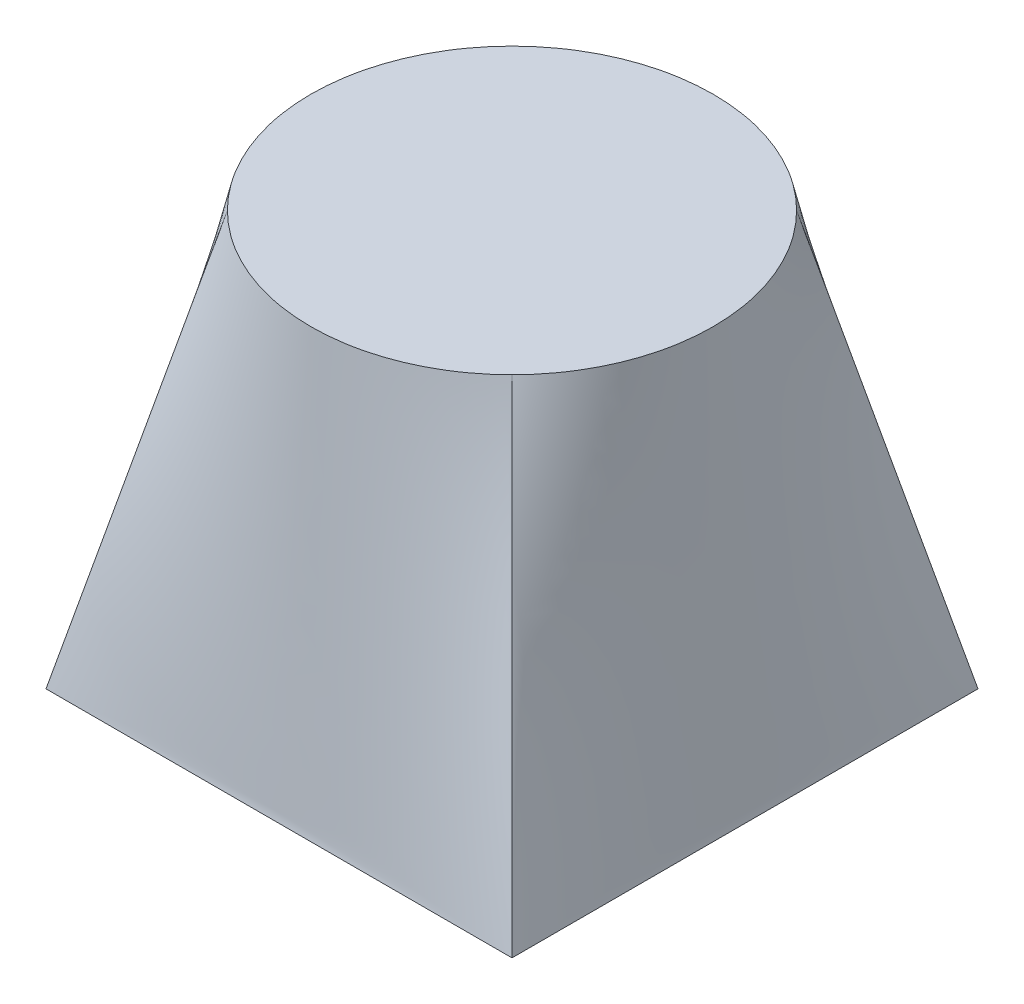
ISO-10303-21;
HEADER;
FILE_DESCRIPTION(('STEP AP214'),'2;1');
FILE_NAME('part.step','',(''),(''),'','','');
FILE_SCHEMA(('AUTOMOTIVE_DESIGN { 1 0 10303 214 1 1 1 1 }'));
ENDSEC;
DATA;
#1=APPLICATION_CONTEXT('core data for automotive mechanical design processes');
#2=APPLICATION_PROTOCOL_DEFINITION('international standard','automotive_design',2000,#1);
#3=PRODUCT_CONTEXT('',#1,'mechanical');
#4=PRODUCT('Part','Part','',(#3));
#5=PRODUCT_RELATED_PRODUCT_CATEGORY('part','',(#4));
#6=PRODUCT_DEFINITION_FORMATION('','',#4);
#7=PRODUCT_DEFINITION_CONTEXT('part definition',#1,'design');
#8=PRODUCT_DEFINITION('design','',#6,#7);
#9=PRODUCT_DEFINITION_SHAPE('','',#8);
#10=(LENGTH_UNIT() NAMED_UNIT(*) SI_UNIT(.MILLI.,.METRE.));
#11=(NAMED_UNIT(*) PLANE_ANGLE_UNIT() SI_UNIT($,.RADIAN.));
#12=(NAMED_UNIT(*) SI_UNIT($,.STERADIAN.) SOLID_ANGLE_UNIT());
#13=UNCERTAINTY_MEASURE_WITH_UNIT(LENGTH_MEASURE(1.E-05),#10,'distance_accuracy_value','');
#14=(GEOMETRIC_REPRESENTATION_CONTEXT(3) GLOBAL_UNCERTAINTY_ASSIGNED_CONTEXT((#13)) GLOBAL_UNIT_ASSIGNED_CONTEXT((#10,
#11,#12)) REPRESENTATION_CONTEXT('',''));
#15=CARTESIAN_POINT('',(0.,0.,0.));
#16=DIRECTION('',(0.,0.,1.));
#17=DIRECTION('',(1.,0.,0.));
#18=AXIS2_PLACEMENT_3D('',#15,#16,#17);
#19=CARTESIAN_POINT('',(56.9277735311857,139.241837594,-23.4363507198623));
#20=DIRECTION('',(0.,1.,0.));
#21=DIRECTION('',(0.,0.,1.));
#22=AXIS2_PLACEMENT_3D('',#19,#20,#21);
#23=PLANE('',#22);
#24=CARTESIAN_POINT('',(56.9277735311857,139.241837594,-23.4363507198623));
#25=DIRECTION('',(0.,1.,0.));
#26=DIRECTION('',(0.,0.,1.));
#27=AXIS2_PLACEMENT_3D('',#24,#25,#26);
#28=CIRCLE('',#27,67.6334368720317);
#29=CARTESIAN_POINT('',(9.1037116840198,139.241837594,-71.2604125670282));
#30=VERTEX_POINT('',#29);
#31=CARTESIAN_POINT('',(9.10371168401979,139.241837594,24.3877111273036));
#32=VERTEX_POINT('',#31);
#33=EDGE_CURVE('E169',#30,#32,#28,.T.);
#34=ORIENTED_EDGE('',*,*,#33,.T.);
#35=CARTESIAN_POINT('',(56.9277735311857,139.241837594,-23.4363507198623));
#36=DIRECTION('',(0.,1.,0.));
#37=DIRECTION('',(0.,0.,1.));
#38=AXIS2_PLACEMENT_3D('',#35,#36,#37);
#39=CIRCLE('',#38,67.6334368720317);
#40=CARTESIAN_POINT('',(104.751835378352,139.241837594,24.3877111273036));
#41=VERTEX_POINT('',#40);
#42=EDGE_CURVE('E131',#32,#41,#39,.T.);
#43=ORIENTED_EDGE('',*,*,#42,.T.);
#44=CARTESIAN_POINT('',(56.9277735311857,139.241837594,-23.4363507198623));
#45=DIRECTION('',(0.,1.,0.));
#46=DIRECTION('',(0.,0.,1.));
#47=AXIS2_PLACEMENT_3D('',#44,#45,#46);
#48=CIRCLE('',#47,67.6334368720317);
#49=CARTESIAN_POINT('',(104.751835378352,139.241837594,-71.2604125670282));
#50=VERTEX_POINT('',#49);
#51=EDGE_CURVE('E112',#41,#50,#48,.T.);
#52=ORIENTED_EDGE('',*,*,#51,.T.);
#53=CARTESIAN_POINT('',(56.9277735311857,139.241837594,-23.4363507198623));
#54=DIRECTION('',(0.,1.,0.));
#55=DIRECTION('',(0.,0.,1.));
#56=AXIS2_PLACEMENT_3D('',#53,#54,#55);
#57=CIRCLE('',#56,67.6334368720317);
#58=EDGE_CURVE('E120',#50,#30,#57,.T.);
#59=ORIENTED_EDGE('',*,*,#58,.T.);
#60=EDGE_LOOP('',(#34,#43,#52,#59));
#61=FACE_BOUND('',#60,.T.);
#62=ADVANCED_FACE('F61',(#61),#23,.T.);
#63=CARTESIAN_POINT('',(135.231835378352,0.,54.8677111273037));
#64=DIRECTION('',(0.,-1.,0.));
#65=DIRECTION('',(0.,0.,-1.));
#66=AXIS2_PLACEMENT_3D('',#63,#64,#65);
#67=PLANE('',#66);
#68=DIRECTION('',(0.,0.,-1.));
#69=VECTOR('',#68,1.);
#70=CARTESIAN_POINT('',(135.231835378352,0.,-101.740412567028));
#71=LINE('',#70,#69);
#72=CARTESIAN_POINT('',(135.231835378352,0.,54.8677111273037));
#73=VERTEX_POINT('',#72);
#74=CARTESIAN_POINT('',(135.231835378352,0.,-101.740412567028));
#75=VERTEX_POINT('',#74);
#76=EDGE_CURVE('E115',#73,#75,#71,.T.);
#77=ORIENTED_EDGE('',*,*,#76,.F.);
#78=DIRECTION('',(1.,0.,0.));
#79=VECTOR('',#78,1.);
#80=CARTESIAN_POINT('',(135.231835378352,0.,54.8677111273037));
#81=LINE('',#80,#79);
#82=CARTESIAN_POINT('',(-21.3762883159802,0.,54.8677111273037));
#83=VERTEX_POINT('',#82);
#84=EDGE_CURVE('E220',#83,#73,#81,.T.);
#85=ORIENTED_EDGE('',*,*,#84,.F.);
#86=DIRECTION('',(0.,0.,1.));
#87=VECTOR('',#86,1.);
#88=CARTESIAN_POINT('',(-21.3762883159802,0.,-101.740412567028));
#89=LINE('',#88,#87);
#90=CARTESIAN_POINT('',(-21.3762883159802,0.,-101.740412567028));
#91=VERTEX_POINT('',#90);
#92=EDGE_CURVE('E73',#91,#83,#89,.T.);
#93=ORIENTED_EDGE('',*,*,#92,.F.);
#94=DIRECTION('',(-1.,0.,0.));
#95=VECTOR('',#94,1.);
#96=CARTESIAN_POINT('',(135.231835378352,0.,-101.740412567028));
#97=LINE('',#96,#95);
#98=EDGE_CURVE('E12',#75,#91,#97,.T.);
#99=ORIENTED_EDGE('',*,*,#98,.F.);
#100=EDGE_LOOP('',(#77,#85,#93,#99));
#101=FACE_BOUND('',#100,.T.);
#102=ADVANCED_FACE('F63',(#101),#67,.T.);
#103=CARTESIAN_POINT('',(-21.3762883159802,0.,54.8677111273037));
#104=CARTESIAN_POINT('',(9.10371168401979,139.241837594,24.3877111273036));
#105=CARTESIAN_POINT('',(-14.8509498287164,0.,54.8677111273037));
#106=CARTESIAN_POINT('',(11.9217715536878,139.241837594,27.2057709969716));
#107=CARTESIAN_POINT('',(-8.32561134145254,0.,54.8677111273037));
#108=CARTESIAN_POINT('',(15.0957359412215,139.241837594,29.8786972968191));
#109=CARTESIAN_POINT('',(4.72506563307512,0.,54.8677111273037));
#110=CARTESIAN_POINT('',(22.1129221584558,139.241837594,34.7043393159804));
#111=CARTESIAN_POINT('',(11.250404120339,0.,54.8677111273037));
#112=CARTESIAN_POINT('',(25.9565023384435,139.241837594,36.8554926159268));
#113=CARTESIAN_POINT('',(24.3010810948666,0.,54.8677111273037));
#114=CARTESIAN_POINT('',(34.174106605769,139.241837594,40.4118806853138));
#115=CARTESIAN_POINT('',(30.8264195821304,0.,54.8677111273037));
#116=CARTESIAN_POINT('',(38.5474873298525,139.241837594,41.8153722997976));
#117=CARTESIAN_POINT('',(43.8770965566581,0.,54.8677111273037));
#118=CARTESIAN_POINT('',(47.5905957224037,139.241837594,43.7085626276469));
#119=CARTESIAN_POINT('',(50.4024350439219,0.,54.8677111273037));
#120=CARTESIAN_POINT('',(52.2586590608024,139.241837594,44.1970861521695));
#121=CARTESIAN_POINT('',(63.4531120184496,0.,54.8677111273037));
#122=CARTESIAN_POINT('',(61.5968880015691,139.241837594,44.1970861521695));
#123=CARTESIAN_POINT('',(69.9784505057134,0.,54.8677111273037));
#124=CARTESIAN_POINT('',(66.2649513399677,139.241837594,43.7085626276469));
#125=CARTESIAN_POINT('',(83.0291274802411,0.,54.8677111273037));
#126=CARTESIAN_POINT('',(75.3080597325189,139.241837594,41.8153722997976));
#127=CARTESIAN_POINT('',(89.5544659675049,0.,54.8677111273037));
#128=CARTESIAN_POINT('',(79.6814404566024,139.241837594,40.4118806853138));
#129=CARTESIAN_POINT('',(102.605142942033,0.,54.8677111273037));
#130=CARTESIAN_POINT('',(87.8990447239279,139.241837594,36.8554926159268));
#131=CARTESIAN_POINT('',(109.130481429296,0.,54.8677111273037));
#132=CARTESIAN_POINT('',(91.7426249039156,139.241837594,34.7043393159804));
#133=CARTESIAN_POINT('',(122.181158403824,0.,54.8677111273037));
#134=CARTESIAN_POINT('',(98.7598111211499,139.241837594,29.8786972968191));
#135=CARTESIAN_POINT('',(128.706496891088,0.,54.8677111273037));
#136=CARTESIAN_POINT('',(101.933775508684,139.241837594,27.2057709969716));
#137=CARTESIAN_POINT('',(135.231835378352,0.,54.8677111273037));
#138=CARTESIAN_POINT('',(104.751835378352,139.241837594,24.3877111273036));
#139=B_SPLINE_SURFACE_WITH_KNOTS('',3,1,((#103,#104),(#105,#106),(#107,#108),(#109,#110),(#111,
#112),(#113,#114),(#115,#116),(#117,#118),(#119,#120),(#121,#122),(#123,#124),(#125,#126),(#127,
#128),(#129,#130),(#131,#132),(#133,#134),(#135,#136),(#137,#138)),.UNSPECIFIED.,.F.,.F.,.F.,(4,
2,2,2,2,2,2,2,4),(2,2),(0.,0.125,0.25,0.375,0.5,0.625,0.75,0.875,1.),(0.,1.),.UNSPECIFIED.);
#140=DIRECTION('',(-0.209109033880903,0.955273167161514,-0.209109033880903));
#141=VECTOR('',#140,1.);
#142=CARTESIAN_POINT('',(119.991835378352,69.620918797,39.6277111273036));
#143=LINE('',#142,#141);
#144=EDGE_CURVE('E214',#73,#41,#143,.T.);
#145=DIRECTION('',(-0.209109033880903,-0.955273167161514,0.209109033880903));
#146=VECTOR('',#145,1.);
#147=CARTESIAN_POINT('',(-6.13628831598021,69.620918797,39.6277111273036));
#148=LINE('',#147,#146);
#149=EDGE_CURVE('E118',#32,#83,#148,.T.);
#150=ORIENTED_EDGE('',*,*,#84,.T.);
#151=ORIENTED_EDGE('',*,*,#144,.T.);
#152=ORIENTED_EDGE('',*,*,#42,.F.);
#153=ORIENTED_EDGE('',*,*,#149,.T.);
#154=EDGE_LOOP('',(#150,#151,#152,#153));
#155=FACE_BOUND('',#154,.T.);
#156=ADVANCED_FACE('F225',(#155),#139,.T.);
#157=CARTESIAN_POINT('',(135.231835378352,0.,54.8677111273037));
#158=CARTESIAN_POINT('',(104.751835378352,139.241837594,24.3877111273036));
#159=CARTESIAN_POINT('',(135.231835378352,0.,48.3423726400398));
#160=CARTESIAN_POINT('',(107.56989524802,139.241837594,21.5696512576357));
#161=CARTESIAN_POINT('',(135.231835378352,0.,41.817034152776));
#162=CARTESIAN_POINT('',(110.242821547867,139.241837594,18.3956868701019));
#163=CARTESIAN_POINT('',(135.231835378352,0.,28.7663571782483));
#164=CARTESIAN_POINT('',(115.068463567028,139.241837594,11.3785006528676));
#165=CARTESIAN_POINT('',(135.231835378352,0.,22.2410186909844));
#166=CARTESIAN_POINT('',(117.219616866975,139.241837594,7.53492047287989));
#167=CARTESIAN_POINT('',(135.231835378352,0.,9.19034171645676));
#168=CARTESIAN_POINT('',(120.776004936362,139.241837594,-0.682683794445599));
#169=CARTESIAN_POINT('',(135.231835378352,0.,2.66500322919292));
#170=CARTESIAN_POINT('',(122.179496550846,139.241837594,-5.05606451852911));
#171=CARTESIAN_POINT('',(135.231835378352,0.,-10.3856737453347));
#172=CARTESIAN_POINT('',(124.072686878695,139.241837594,-14.0991729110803));
#173=CARTESIAN_POINT('',(135.231835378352,0.,-16.9110122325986));
#174=CARTESIAN_POINT('',(124.561210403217,139.241837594,-18.7672362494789));
#175=CARTESIAN_POINT('',(135.231835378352,0.,-29.9616892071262));
#176=CARTESIAN_POINT('',(124.561210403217,139.241837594,-28.1054651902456));
#177=CARTESIAN_POINT('',(135.231835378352,0.,-36.4870276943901));
#178=CARTESIAN_POINT('',(124.072686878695,139.241837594,-32.7735285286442));
#179=CARTESIAN_POINT('',(135.231835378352,0.,-49.5377046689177));
#180=CARTESIAN_POINT('',(122.179496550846,139.241837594,-41.8166369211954));
#181=CARTESIAN_POINT('',(135.231835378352,0.,-56.0630431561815));
#182=CARTESIAN_POINT('',(120.776004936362,139.241837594,-46.1900176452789));
#183=CARTESIAN_POINT('',(135.231835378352,0.,-69.1137201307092));
#184=CARTESIAN_POINT('',(117.219616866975,139.241837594,-54.4076219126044));
#185=CARTESIAN_POINT('',(135.231835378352,0.,-75.639058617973));
#186=CARTESIAN_POINT('',(115.068463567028,139.241837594,-58.2512020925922));
#187=CARTESIAN_POINT('',(135.231835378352,0.,-88.6897355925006));
#188=CARTESIAN_POINT('',(110.242821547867,139.241837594,-65.2683883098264));
#189=CARTESIAN_POINT('',(135.231835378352,0.,-95.2150740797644));
#190=CARTESIAN_POINT('',(107.56989524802,139.241837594,-68.4423526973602));
#191=CARTESIAN_POINT('',(135.231835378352,0.,-101.740412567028));
#192=CARTESIAN_POINT('',(104.751835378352,139.241837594,-71.2604125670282));
#193=B_SPLINE_SURFACE_WITH_KNOTS('',3,1,((#157,#158),(#159,#160),(#161,#162),(#163,#164),(#165,
#166),(#167,#168),(#169,#170),(#171,#172),(#173,#174),(#175,#176),(#177,#178),(#179,#180),(#181,
#182),(#183,#184),(#185,#186),(#187,#188),(#189,#190),(#191,#192)),.UNSPECIFIED.,.F.,.F.,.F.,(4,
2,2,2,2,2,2,2,4),(2,2),(0.,0.125,0.25,0.375,0.5,0.625,0.75,0.875,1.),(0.,1.),.UNSPECIFIED.);
#194=DIRECTION('',(-0.209109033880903,0.955273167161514,0.209109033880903));
#195=VECTOR('',#194,1.);
#196=CARTESIAN_POINT('',(119.991835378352,69.620918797,-86.5004125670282));
#197=LINE('',#196,#195);
#198=EDGE_CURVE('E107',#75,#50,#197,.T.);
#199=ORIENTED_EDGE('',*,*,#76,.T.);
#200=ORIENTED_EDGE('',*,*,#198,.T.);
#201=ORIENTED_EDGE('',*,*,#51,.F.);
#202=ORIENTED_EDGE('',*,*,#144,.F.);
#203=EDGE_LOOP('',(#199,#200,#201,#202));
#204=FACE_BOUND('',#203,.T.);
#205=ADVANCED_FACE('F109',(#204),#193,.T.);
#206=CARTESIAN_POINT('',(-21.3762883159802,0.,-101.740412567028));
#207=CARTESIAN_POINT('',(9.10371168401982,139.241837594,-71.2604125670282));
#208=CARTESIAN_POINT('',(-21.3762883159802,0.,-95.2150740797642));
#209=CARTESIAN_POINT('',(6.28565181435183,139.241837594,-68.4423526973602));
#210=CARTESIAN_POINT('',(-21.3762883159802,0.,-88.6897355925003));
#211=CARTESIAN_POINT('',(3.6127255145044,139.241837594,-65.2683883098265));
#212=CARTESIAN_POINT('',(-21.3762883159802,0.,-75.6390586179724));
#213=CARTESIAN_POINT('',(-1.21291650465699,139.241837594,-58.2512020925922));
#214=CARTESIAN_POINT('',(-21.3762883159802,0.,-69.1137201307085));
#215=CARTESIAN_POINT('',(-3.36406980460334,139.241837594,-54.4076219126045));
#216=CARTESIAN_POINT('',(-21.3762883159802,0.,-56.0630431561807));
#217=CARTESIAN_POINT('',(-6.92045787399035,139.241837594,-46.190017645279));
#218=CARTESIAN_POINT('',(-21.3762883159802,0.,-49.5377046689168));
#219=CARTESIAN_POINT('',(-8.32394948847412,139.241837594,-41.8166369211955));
#220=CARTESIAN_POINT('',(-21.3762883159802,0.,-36.4870276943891));
#221=CARTESIAN_POINT('',(-10.2171398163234,139.241837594,-32.7735285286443));
#222=CARTESIAN_POINT('',(-21.3762883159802,0.,-29.9616892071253));
#223=CARTESIAN_POINT('',(-10.705663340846,139.241837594,-28.1054651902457));
#224=CARTESIAN_POINT('',(-21.3762883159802,0.,-16.9110122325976));
#225=CARTESIAN_POINT('',(-10.705663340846,139.241837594,-18.7672362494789));
#226=CARTESIAN_POINT('',(-21.3762883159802,0.,-10.3856737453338));
#227=CARTESIAN_POINT('',(-10.2171398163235,139.241837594,-14.0991729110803));
#228=CARTESIAN_POINT('',(-21.3762883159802,0.,2.66500322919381));
#229=CARTESIAN_POINT('',(-8.32394948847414,139.241837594,-5.05606451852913));
#230=CARTESIAN_POINT('',(-21.3762883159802,0.,9.19034171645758));
#231=CARTESIAN_POINT('',(-6.92045787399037,139.241837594,-0.682683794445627));
#232=CARTESIAN_POINT('',(-21.3762883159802,0.,22.2410186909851));
#233=CARTESIAN_POINT('',(-3.36406980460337,139.241837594,7.53492047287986));
#234=CARTESIAN_POINT('',(-21.3762883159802,0.,28.7663571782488));
#235=CARTESIAN_POINT('',(-1.21291650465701,139.241837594,11.3785006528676));
#236=CARTESIAN_POINT('',(-21.3762883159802,0.,41.8170341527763));
#237=CARTESIAN_POINT('',(3.61272551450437,139.241837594,18.3956868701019));
#238=CARTESIAN_POINT('',(-21.3762883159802,0.,48.34237264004));
#239=CARTESIAN_POINT('',(6.2856518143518,139.241837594,21.5696512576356));
#240=CARTESIAN_POINT('',(-21.3762883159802,0.,54.8677111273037));
#241=CARTESIAN_POINT('',(9.10371168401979,139.241837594,24.3877111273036));
#242=B_SPLINE_SURFACE_WITH_KNOTS('',3,1,((#206,#207),(#208,#209),(#210,#211),(#212,#213),(#214,
#215),(#216,#217),(#218,#219),(#220,#221),(#222,#223),(#224,#225),(#226,#227),(#228,#229),(#230,
#231),(#232,#233),(#234,#235),(#236,#237),(#238,#239),(#240,#241)),.UNSPECIFIED.,.F.,.F.,.F.,(4,
2,2,2,2,2,2,2,4),(2,2),(0.,0.125,0.25,0.375,0.5,0.625,0.75,0.875,1.),(0.,1.),.UNSPECIFIED.);
#243=DIRECTION('',(0.209109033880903,0.955273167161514,0.209109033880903));
#244=VECTOR('',#243,1.);
#245=CARTESIAN_POINT('',(-6.1362883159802,69.620918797,-86.5004125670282));
#246=LINE('',#245,#244);
#247=EDGE_CURVE('E81',#91,#30,#246,.T.);
#248=ORIENTED_EDGE('',*,*,#92,.T.);
#249=ORIENTED_EDGE('',*,*,#149,.F.);
#250=ORIENTED_EDGE('',*,*,#33,.F.);
#251=ORIENTED_EDGE('',*,*,#247,.F.);
#252=EDGE_LOOP('',(#248,#249,#250,#251));
#253=FACE_BOUND('',#252,.T.);
#254=ADVANCED_FACE('F174',(#253),#242,.T.);
#255=CARTESIAN_POINT('',(135.231835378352,0.,-101.740412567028));
#256=CARTESIAN_POINT('',(104.751835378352,139.241837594,-71.2604125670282));
#257=CARTESIAN_POINT('',(128.706496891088,0.,-101.740412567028));
#258=CARTESIAN_POINT('',(101.933775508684,139.241837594,-74.0784724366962));
#259=CARTESIAN_POINT('',(122.181158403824,0.,-101.740412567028));
#260=CARTESIAN_POINT('',(98.7598111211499,139.241837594,-76.7513987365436));
#261=CARTESIAN_POINT('',(109.130481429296,0.,-101.740412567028));
#262=CARTESIAN_POINT('',(91.7426249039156,139.241837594,-81.5770407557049));
#263=CARTESIAN_POINT('',(102.605142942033,0.,-101.740412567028));
#264=CARTESIAN_POINT('',(87.8990447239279,139.241837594,-83.7281940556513));
#265=CARTESIAN_POINT('',(89.5544659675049,0.,-101.740412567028));
#266=CARTESIAN_POINT('',(79.6814404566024,139.241837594,-87.2845821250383));
#267=CARTESIAN_POINT('',(83.0291274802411,0.,-101.740412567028));
#268=CARTESIAN_POINT('',(75.3080597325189,139.241837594,-88.6880737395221));
#269=CARTESIAN_POINT('',(69.9784505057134,0.,-101.740412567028));
#270=CARTESIAN_POINT('',(66.2649513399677,139.241837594,-90.5812640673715));
#271=CARTESIAN_POINT('',(63.4531120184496,0.,-101.740412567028));
#272=CARTESIAN_POINT('',(61.5968880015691,139.241837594,-91.069787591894));
#273=CARTESIAN_POINT('',(50.4024350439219,0.,-101.740412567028));
#274=CARTESIAN_POINT('',(52.2586590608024,139.241837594,-91.069787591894));
#275=CARTESIAN_POINT('',(43.8770965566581,0.,-101.740412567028));
#276=CARTESIAN_POINT('',(47.5905957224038,139.241837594,-90.5812640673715));
#277=CARTESIAN_POINT('',(30.8264195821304,0.,-101.740412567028));
#278=CARTESIAN_POINT('',(38.5474873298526,139.241837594,-88.6880737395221));
#279=CARTESIAN_POINT('',(24.3010810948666,0.,-101.740412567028));
#280=CARTESIAN_POINT('',(34.1741066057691,139.241837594,-87.2845821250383));
#281=CARTESIAN_POINT('',(11.250404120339,0.,-101.740412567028));
#282=CARTESIAN_POINT('',(25.9565023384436,139.241837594,-83.7281940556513));
#283=CARTESIAN_POINT('',(4.72506563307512,0.,-101.740412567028));
#284=CARTESIAN_POINT('',(22.1129221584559,139.241837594,-81.577040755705));
#285=CARTESIAN_POINT('',(-8.32561134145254,0.,-101.740412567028));
#286=CARTESIAN_POINT('',(15.0957359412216,139.241837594,-76.7513987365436));
#287=CARTESIAN_POINT('',(-14.8509498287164,0.,-101.740412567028));
#288=CARTESIAN_POINT('',(11.9217715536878,139.241837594,-74.0784724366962));
#289=CARTESIAN_POINT('',(-21.3762883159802,0.,-101.740412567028));
#290=CARTESIAN_POINT('',(9.10371168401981,139.241837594,-71.2604125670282));
#291=B_SPLINE_SURFACE_WITH_KNOTS('',3,1,((#255,#256),(#257,#258),(#259,#260),(#261,#262),(#263,
#264),(#265,#266),(#267,#268),(#269,#270),(#271,#272),(#273,#274),(#275,#276),(#277,#278),(#279,
#280),(#281,#282),(#283,#284),(#285,#286),(#287,#288),(#289,#290)),.UNSPECIFIED.,.F.,.F.,.F.,(4,
2,2,2,2,2,2,2,4),(2,2),(0.,0.125,0.25,0.375,0.5,0.625,0.75,0.875,1.),(0.,1.),.UNSPECIFIED.);
#292=ORIENTED_EDGE('',*,*,#98,.T.);
#293=ORIENTED_EDGE('',*,*,#247,.T.);
#294=ORIENTED_EDGE('',*,*,#58,.F.);
#295=ORIENTED_EDGE('',*,*,#198,.F.);
#296=EDGE_LOOP('',(#292,#293,#294,#295));
#297=FACE_BOUND('',#296,.T.);
#298=ADVANCED_FACE('F122',(#297),#291,.T.);
#299=CLOSED_SHELL('',(#62,#102,#156,#205,#254,#298));
#300=MANIFOLD_SOLID_BREP('B2',#299);
#301=ADVANCED_BREP_SHAPE_REPRESENTATION('',(#18,#300),#14);
#302=SHAPE_DEFINITION_REPRESENTATION(#9,#301);
ENDSEC;
END-ISO-10303-21;
